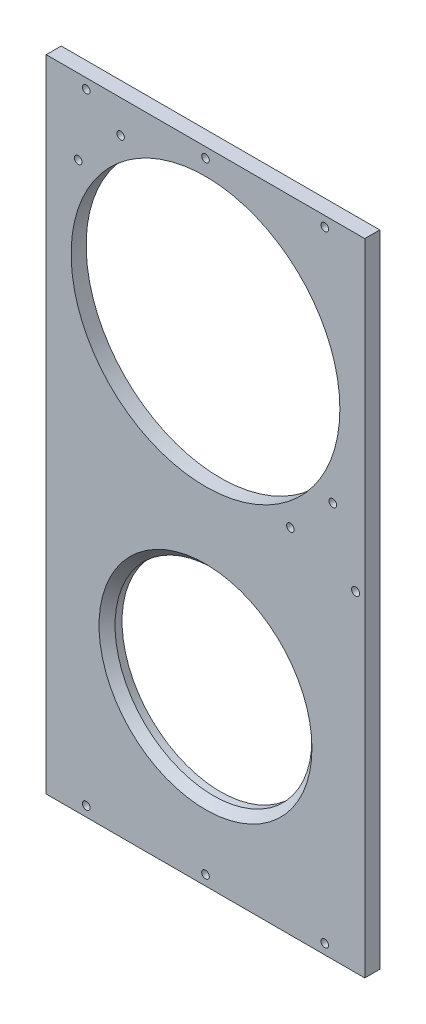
from build123d import *

# Parameters (mm, degrees)
SKETCH1_W                     = 202.184
SKETCH1_H                     = 406.4
PLATE_DEPTH                   = 9.525
SKETCH2_R                     = 62.484
SKETCH2_R_2                   = 85.2805
HOLES_DEPTH                   = 455.015479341
CHAMFER1_SIZE                 = 5.08
SKETCH3_R                     = 2.413
GLASS_RETAINER_MOUNTING_DEPTH = 455.015479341
SKETCH4_R                     = 2.413
END_STOP_HOLES_DEPTH          = 455.015479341
SKETCH5_R                     = 2.54
CUT_EXTRUDE1_DEPTH            = 455.015479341


with BuildPart() as part:
    # Sketch1 → plate (new body)
    with BuildSketch(Plane.XY):
        with Locations((-101.092, -203.2)):
            Rectangle(SKETCH1_W, SKETCH1_H)
    extrude(amount=PLATE_DEPTH)

    # Sketch2 → holes (cut, through all)
    with BuildSketch(Plane.XY.offset(9.525)):
        with Locations((-101.092, -296.8625)):
            Circle(SKETCH2_R)
        with Locations((-101.092, -101.6)):
            Circle(SKETCH2_R_2)
    extrude(amount=-HOLES_DEPTH, mode=Mode.SUBTRACT)

    # Chamfer1
    chamfer1_edges = [part.edges().sort_by_distance(p)[0] for p in [
        (-163.576, -296.8625, 9.525),
    ]]
    chamfer(chamfer1_edges, length=CHAMFER1_SIZE)

    # Sketch3 → glass retainer mounting (cut, through all)
    with BuildSketch(Plane.XY.offset(9.525)):
        with Locations((-154.973536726, -20.77769491)):
            Circle(SKETCH3_R)
        with Locations((-181.91430509, -47.718463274)):
            Circle(SKETCH3_R)
        with Locations((-47.210463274, -182.42230509)):
            Circle(SKETCH3_R)
        with Locations((-20.26969491, -155.481536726)):
            Circle(SKETCH3_R)
    extrude(amount=-GLASS_RETAINER_MOUNTING_DEPTH, mode=Mode.SUBTRACT)

    # Sketch4 → end stop holes (cut, through all)
    with BuildSketch(Plane.XY.offset(9.525)):
        with Locations((-176.784, -6.35)):
            Circle(SKETCH4_R)
        with Locations((-101.092, -6.35)):
            Circle(SKETCH4_R)
        with Locations((-25.4, -6.35)):
            Circle(SKETCH4_R)
        with Locations((-176.784, -400.05)):
            Circle(SKETCH4_R)
        with Locations((-101.092, -400.05)):
            Circle(SKETCH4_R)
        with Locations((-25.4, -400.05)):
            Circle(SKETCH4_R)
    extrude(amount=-END_STOP_HOLES_DEPTH, mode=Mode.SUBTRACT)

    # Sketch5 → Cut-Extrude1 (cut, through all)
    with BuildSketch(Plane.XY.offset(9.525)):
        with Locations((-5.842, -196.85)):
            Circle(SKETCH5_R)
    extrude(amount=-CUT_EXTRUDE1_DEPTH, mode=Mode.SUBTRACT)


solid = part.part
